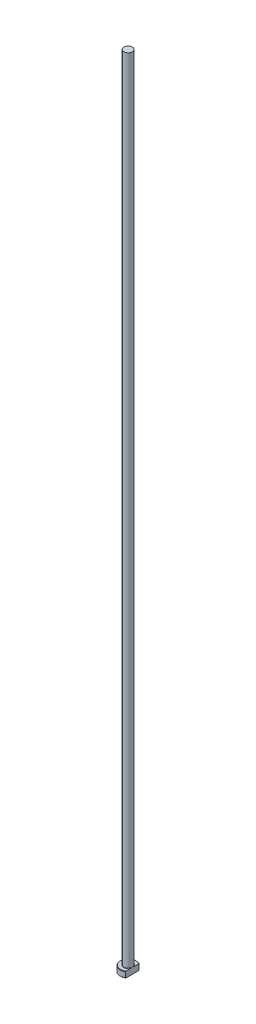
from build123d import *
from build123d.topology import SkipClean

# Parameters (mm, degrees)
CHAMFER1_SIZE = 0.2
FILLET1_R     = 0.2
KEY_DEPTH     = 401.039998


with BuildPart() as part:
    # Sketch1 → Revolve1 (revolve)
    with BuildSketch(Plane.XY, mode=Mode.PRIVATE) as revolve1_sk:
        Polygon((0, 0), (-4, 0), (-4, 3), (-2.1, 3), (-2.1, 400), (0, 400), align=None)
    revolve(revolve1_sk.sketch.rotate(Axis((0, 259.958771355, 0), (0, -1, 0)), 270), axis=Axis((0, 259.958771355, 0), (0, -1, 0)))

    # Chamfer1
    chamfer1_edges = [part.edges().sort_by_distance(p)[0] for p in [
        (0, 3, -4),
        (0, 0, -4),
    ]]
    chamfer(chamfer1_edges, length=CHAMFER1_SIZE)

    # Fillet1
    fillet1_edges = [part.edges().sort_by_distance(p)[0] for p in [
        (0, 3, -2.1),
    ]]
    fillet(fillet1_edges, radius=FILLET1_R)

    # Sketch2 → KEY (cut, through all)
    with SkipClean():  # the faces are left unmerged after this step: merging them gives an invalid solid
        with BuildSketch(Plane(origin=(0, 0, 0), x_dir=(1, 0, 0), z_dir=(0, 1, 0))):
            with BuildLine():
                Line((2.1, 3.404408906), (2.1, -3.404408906))
                ThreePointArc((2.1, -3.404408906), (4, 0), (2.1, 3.404408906))
            make_face()
        extrude(amount=KEY_DEPTH, mode=Mode.SUBTRACT)


solid = part.part
